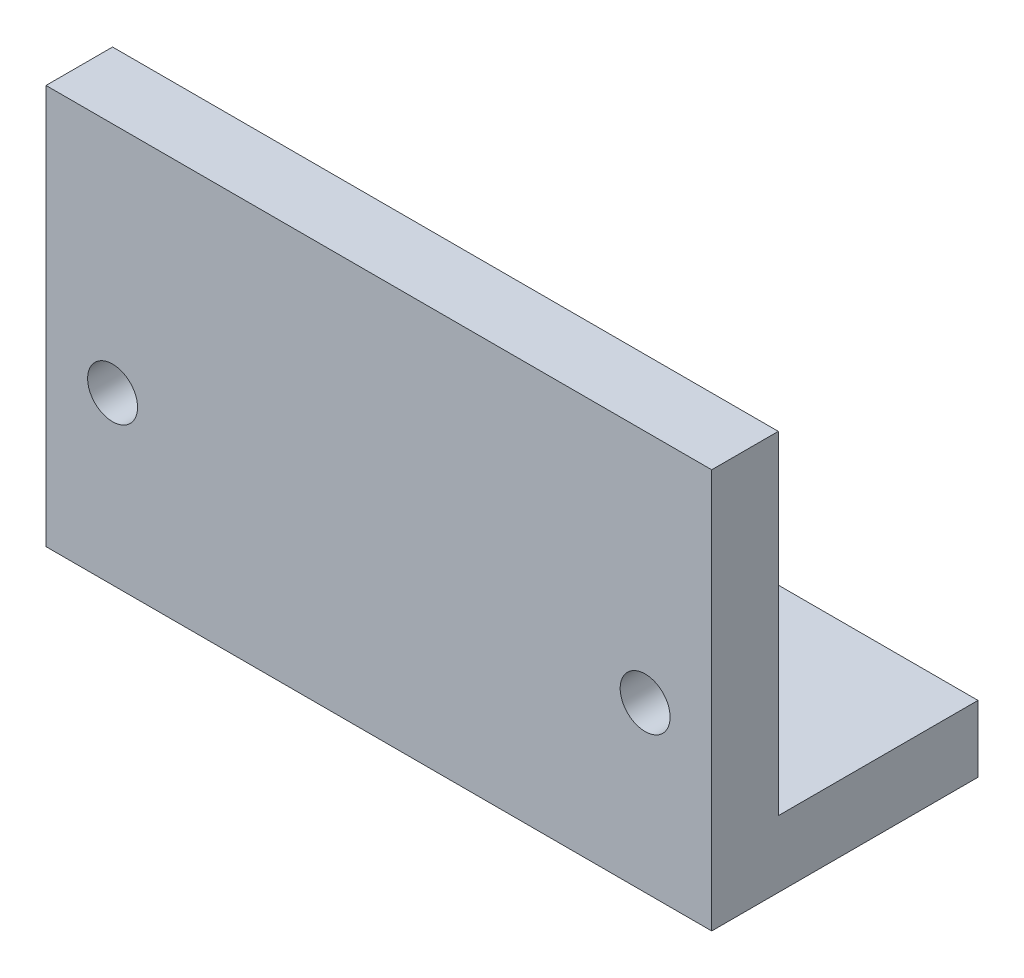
ISO-10303-21;
HEADER;
FILE_DESCRIPTION(('STEP AP214'),'2;1');
FILE_NAME('part.step','',(''),(''),'','','');
FILE_SCHEMA(('AUTOMOTIVE_DESIGN { 1 0 10303 214 1 1 1 1 }'));
ENDSEC;
DATA;
#1=APPLICATION_CONTEXT('core data for automotive mechanical design processes');
#2=APPLICATION_PROTOCOL_DEFINITION('international standard','automotive_design',2000,#1);
#3=PRODUCT_CONTEXT('',#1,'mechanical');
#4=PRODUCT('Part','Part','',(#3));
#5=PRODUCT_RELATED_PRODUCT_CATEGORY('part','',(#4));
#6=PRODUCT_DEFINITION_FORMATION('','',#4);
#7=PRODUCT_DEFINITION_CONTEXT('part definition',#1,'design');
#8=PRODUCT_DEFINITION('design','',#6,#7);
#9=PRODUCT_DEFINITION_SHAPE('','',#8);
#10=(LENGTH_UNIT() NAMED_UNIT(*) SI_UNIT(.MILLI.,.METRE.));
#11=(NAMED_UNIT(*) PLANE_ANGLE_UNIT() SI_UNIT($,.RADIAN.));
#12=(NAMED_UNIT(*) SI_UNIT($,.STERADIAN.) SOLID_ANGLE_UNIT());
#13=UNCERTAINTY_MEASURE_WITH_UNIT(LENGTH_MEASURE(1.E-05),#10,'distance_accuracy_value','');
#14=(GEOMETRIC_REPRESENTATION_CONTEXT(3) GLOBAL_UNCERTAINTY_ASSIGNED_CONTEXT((#13)) GLOBAL_UNIT_ASSIGNED_CONTEXT((#10,
#11,#12)) REPRESENTATION_CONTEXT('',''));
#15=CARTESIAN_POINT('',(0.,0.,0.));
#16=DIRECTION('',(0.,0.,1.));
#17=DIRECTION('',(1.,0.,0.));
#18=AXIS2_PLACEMENT_3D('',#15,#16,#17);
#19=CARTESIAN_POINT('',(0.,0.,20.));
#20=DIRECTION('',(1.,0.,0.));
#21=DIRECTION('',(0.,0.,-1.));
#22=AXIS2_PLACEMENT_3D('',#19,#20,#21);
#23=PLANE('',#22);
#24=DIRECTION('',(0.,-1.,0.));
#25=VECTOR('',#24,1.);
#26=CARTESIAN_POINT('',(0.,0.,0.));
#27=LINE('',#26,#25);
#28=CARTESIAN_POINT('',(0.,120.,0.));
#29=VERTEX_POINT('',#28);
#30=CARTESIAN_POINT('',(0.,20.,0.));
#31=VERTEX_POINT('',#30);
#32=EDGE_CURVE('E142',#29,#31,#27,.T.);
#33=ORIENTED_EDGE('',*,*,#32,.T.);
#34=DIRECTION('',(0.,0.,1.));
#35=VECTOR('',#34,1.);
#36=CARTESIAN_POINT('',(0.,20.,-60.));
#37=LINE('',#36,#35);
#38=CARTESIAN_POINT('',(0.,20.,-60.));
#39=VERTEX_POINT('',#38);
#40=EDGE_CURVE('E137',#39,#31,#37,.T.);
#41=ORIENTED_EDGE('',*,*,#40,.F.);
#42=DIRECTION('',(0.,1.,0.));
#43=VECTOR('',#42,1.);
#44=CARTESIAN_POINT('',(0.,0.,-60.));
#45=LINE('',#44,#43);
#46=CARTESIAN_POINT('',(0.,0.,-60.));
#47=VERTEX_POINT('',#46);
#48=EDGE_CURVE('E111',#47,#39,#45,.T.);
#49=ORIENTED_EDGE('',*,*,#48,.F.);
#50=DIRECTION('',(0.,0.,-1.));
#51=VECTOR('',#50,1.);
#52=CARTESIAN_POINT('',(0.,0.,20.));
#53=LINE('',#52,#51);
#54=CARTESIAN_POINT('',(0.,0.,20.));
#55=VERTEX_POINT('',#54);
#56=EDGE_CURVE('E11',#55,#47,#53,.T.);
#57=ORIENTED_EDGE('',*,*,#56,.F.);
#58=DIRECTION('',(0.,-1.,0.));
#59=VECTOR('',#58,1.);
#60=CARTESIAN_POINT('',(0.,0.,20.));
#61=LINE('',#60,#59);
#62=CARTESIAN_POINT('',(0.,120.,20.));
#63=VERTEX_POINT('',#62);
#64=EDGE_CURVE('E129',#63,#55,#61,.T.);
#65=ORIENTED_EDGE('',*,*,#64,.F.);
#66=DIRECTION('',(0.,0.,-1.));
#67=VECTOR('',#66,1.);
#68=CARTESIAN_POINT('',(0.,120.,20.));
#69=LINE('',#68,#67);
#70=EDGE_CURVE('E170',#63,#29,#69,.T.);
#71=ORIENTED_EDGE('',*,*,#70,.T.);
#72=EDGE_LOOP('',(#33,#41,#49,#57,#65,#71));
#73=FACE_BOUND('',#72,.T.);
#74=ADVANCED_FACE('F33',(#73),#23,.F.);
#75=CARTESIAN_POINT('',(0.,0.,20.));
#76=DIRECTION('',(0.,1.,0.));
#77=DIRECTION('',(0.,0.,1.));
#78=AXIS2_PLACEMENT_3D('',#75,#76,#77);
#79=PLANE('',#78);
#80=ORIENTED_EDGE('',*,*,#56,.T.);
#81=DIRECTION('',(-1.,0.,0.));
#82=VECTOR('',#81,1.);
#83=CARTESIAN_POINT('',(200.,0.,-60.));
#84=LINE('',#83,#82);
#85=CARTESIAN_POINT('',(200.,0.,-60.));
#86=VERTEX_POINT('',#85);
#87=EDGE_CURVE('E106',#86,#47,#84,.T.);
#88=ORIENTED_EDGE('',*,*,#87,.F.);
#89=DIRECTION('',(0.,0.,-1.));
#90=VECTOR('',#89,1.);
#91=CARTESIAN_POINT('',(200.,0.,20.));
#92=LINE('',#91,#90);
#93=CARTESIAN_POINT('',(200.,0.,20.));
#94=VERTEX_POINT('',#93);
#95=EDGE_CURVE('E41',#94,#86,#92,.T.);
#96=ORIENTED_EDGE('',*,*,#95,.F.);
#97=DIRECTION('',(1.,0.,0.));
#98=VECTOR('',#97,1.);
#99=CARTESIAN_POINT('',(0.,0.,20.));
#100=LINE('',#99,#98);
#101=EDGE_CURVE('E80',#55,#94,#100,.T.);
#102=ORIENTED_EDGE('',*,*,#101,.F.);
#103=EDGE_LOOP('',(#80,#88,#96,#102));
#104=FACE_BOUND('',#103,.T.);
#105=ADVANCED_FACE('F107',(#104),#79,.F.);
#106=CARTESIAN_POINT('',(200.,0.,20.));
#107=DIRECTION('',(-1.,0.,0.));
#108=DIRECTION('',(0.,0.,1.));
#109=AXIS2_PLACEMENT_3D('',#106,#107,#108);
#110=PLANE('',#109);
#111=ORIENTED_EDGE('',*,*,#95,.T.);
#112=DIRECTION('',(0.,-1.,0.));
#113=VECTOR('',#112,1.);
#114=CARTESIAN_POINT('',(200.,0.,-60.));
#115=LINE('',#114,#113);
#116=CARTESIAN_POINT('',(200.,20.,-60.));
#117=VERTEX_POINT('',#116);
#118=EDGE_CURVE('E100',#117,#86,#115,.T.);
#119=ORIENTED_EDGE('',*,*,#118,.F.);
#120=DIRECTION('',(0.,0.,1.));
#121=VECTOR('',#120,1.);
#122=CARTESIAN_POINT('',(200.,20.,-60.));
#123=LINE('',#122,#121);
#124=CARTESIAN_POINT('',(200.,20.,0.));
#125=VERTEX_POINT('',#124);
#126=EDGE_CURVE('E126',#117,#125,#123,.T.);
#127=ORIENTED_EDGE('',*,*,#126,.T.);
#128=DIRECTION('',(0.,1.,0.));
#129=VECTOR('',#128,1.);
#130=CARTESIAN_POINT('',(200.,0.,0.));
#131=LINE('',#130,#129);
#132=CARTESIAN_POINT('',(200.,120.,0.));
#133=VERTEX_POINT('',#132);
#134=EDGE_CURVE('E133',#125,#133,#131,.T.);
#135=ORIENTED_EDGE('',*,*,#134,.T.);
#136=DIRECTION('',(0.,0.,-1.));
#137=VECTOR('',#136,1.);
#138=CARTESIAN_POINT('',(200.,120.,20.));
#139=LINE('',#138,#137);
#140=CARTESIAN_POINT('',(200.,120.,20.));
#141=VERTEX_POINT('',#140);
#142=EDGE_CURVE('E103',#141,#133,#139,.T.);
#143=ORIENTED_EDGE('',*,*,#142,.F.);
#144=DIRECTION('',(0.,1.,0.));
#145=VECTOR('',#144,1.);
#146=CARTESIAN_POINT('',(200.,0.,20.));
#147=LINE('',#146,#145);
#148=EDGE_CURVE('E102',#94,#141,#147,.T.);
#149=ORIENTED_EDGE('',*,*,#148,.F.);
#150=EDGE_LOOP('',(#111,#119,#127,#135,#143,#149));
#151=FACE_BOUND('',#150,.T.);
#152=ADVANCED_FACE('F97',(#151),#110,.F.);
#153=CARTESIAN_POINT('',(0.,120.,20.));
#154=DIRECTION('',(0.,-1.,0.));
#155=DIRECTION('',(0.,0.,-1.));
#156=AXIS2_PLACEMENT_3D('',#153,#154,#155);
#157=PLANE('',#156);
#158=DIRECTION('',(-1.,0.,0.));
#159=VECTOR('',#158,1.);
#160=CARTESIAN_POINT('',(0.,120.,0.));
#161=LINE('',#160,#159);
#162=EDGE_CURVE('E73',#133,#29,#161,.T.);
#163=ORIENTED_EDGE('',*,*,#162,.T.);
#164=ORIENTED_EDGE('',*,*,#70,.F.);
#165=DIRECTION('',(-1.,0.,0.));
#166=VECTOR('',#165,1.);
#167=CARTESIAN_POINT('',(0.,120.,20.));
#168=LINE('',#167,#166);
#169=EDGE_CURVE('E58',#141,#63,#168,.T.);
#170=ORIENTED_EDGE('',*,*,#169,.F.);
#171=ORIENTED_EDGE('',*,*,#142,.T.);
#172=EDGE_LOOP('',(#163,#164,#170,#171));
#173=FACE_BOUND('',#172,.T.);
#174=ADVANCED_FACE('F163',(#173),#157,.F.);
#175=CARTESIAN_POINT('',(0.,120.,20.));
#176=DIRECTION('',(0.,0.,-1.));
#177=DIRECTION('',(-1.,0.,0.));
#178=AXIS2_PLACEMENT_3D('',#175,#176,#177);
#179=PLANE('',#178);
#180=CARTESIAN_POINT('',(180.,49.3880748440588,20.));
#181=DIRECTION('',(0.,0.,1.));
#182=DIRECTION('',(1.,0.,0.));
#183=AXIS2_PLACEMENT_3D('',#180,#181,#182);
#184=CIRCLE('',#183,7.50000000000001);
#185=CARTESIAN_POINT('',(187.5,49.3880748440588,20.));
#186=VERTEX_POINT('',#185);
#187=EDGE_CURVE('E151',#186,#186,#184,.T.);
#188=ORIENTED_EDGE('',*,*,#187,.F.);
#189=EDGE_LOOP('',(#188));
#190=FACE_BOUND('',#189,.T.);
#191=CARTESIAN_POINT('',(20.,50.,20.));
#192=DIRECTION('',(0.,0.,1.));
#193=DIRECTION('',(1.,0.,0.));
#194=AXIS2_PLACEMENT_3D('',#191,#192,#193);
#195=CIRCLE('',#194,7.5);
#196=CARTESIAN_POINT('',(27.5,50.,20.));
#197=VERTEX_POINT('',#196);
#198=EDGE_CURVE('E121',#197,#197,#195,.T.);
#199=ORIENTED_EDGE('',*,*,#198,.F.);
#200=EDGE_LOOP('',(#199));
#201=FACE_BOUND('',#200,.T.);
#202=ORIENTED_EDGE('',*,*,#64,.T.);
#203=ORIENTED_EDGE('',*,*,#101,.T.);
#204=ORIENTED_EDGE('',*,*,#148,.T.);
#205=ORIENTED_EDGE('',*,*,#169,.T.);
#206=EDGE_LOOP('',(#202,#203,#204,#205));
#207=FACE_BOUND('',#206,.T.);
#208=ADVANCED_FACE('F159',(#190,#201,#207),#179,.F.);
#209=CARTESIAN_POINT('',(0.,120.,0.));
#210=DIRECTION('',(0.,0.,-1.));
#211=DIRECTION('',(-1.,0.,0.));
#212=AXIS2_PLACEMENT_3D('',#209,#210,#211);
#213=PLANE('',#212);
#214=CARTESIAN_POINT('',(180.,49.3880748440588,0.));
#215=DIRECTION('',(0.,0.,-1.));
#216=DIRECTION('',(-1.,0.,0.));
#217=AXIS2_PLACEMENT_3D('',#214,#215,#216);
#218=CIRCLE('',#217,7.50000000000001);
#219=CARTESIAN_POINT('',(187.5,49.3880748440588,0.));
#220=VERTEX_POINT('',#219);
#221=EDGE_CURVE('E36',#220,#220,#218,.T.);
#222=ORIENTED_EDGE('',*,*,#221,.F.);
#223=EDGE_LOOP('',(#222));
#224=FACE_BOUND('',#223,.T.);
#225=CARTESIAN_POINT('',(20.,50.,0.));
#226=DIRECTION('',(0.,0.,-1.));
#227=DIRECTION('',(-1.,0.,0.));
#228=AXIS2_PLACEMENT_3D('',#225,#226,#227);
#229=CIRCLE('',#228,7.5);
#230=CARTESIAN_POINT('',(27.5,50.,0.));
#231=VERTEX_POINT('',#230);
#232=EDGE_CURVE('E118',#231,#231,#229,.T.);
#233=ORIENTED_EDGE('',*,*,#232,.F.);
#234=EDGE_LOOP('',(#233));
#235=FACE_BOUND('',#234,.T.);
#236=DIRECTION('',(1.,0.,0.));
#237=VECTOR('',#236,1.);
#238=CARTESIAN_POINT('',(200.,20.,0.));
#239=LINE('',#238,#237);
#240=EDGE_CURVE('E49',#31,#125,#239,.T.);
#241=ORIENTED_EDGE('',*,*,#240,.F.);
#242=ORIENTED_EDGE('',*,*,#32,.F.);
#243=ORIENTED_EDGE('',*,*,#162,.F.);
#244=ORIENTED_EDGE('',*,*,#134,.F.);
#245=EDGE_LOOP('',(#241,#242,#243,#244));
#246=FACE_BOUND('',#245,.T.);
#247=ADVANCED_FACE('F162',(#224,#235,#246),#213,.T.);
#248=CARTESIAN_POINT('',(200.,20.,-60.));
#249=DIRECTION('',(0.,-1.,0.));
#250=DIRECTION('',(1.,0.,0.));
#251=AXIS2_PLACEMENT_3D('',#248,#249,#250);
#252=PLANE('',#251);
#253=ORIENTED_EDGE('',*,*,#240,.T.);
#254=ORIENTED_EDGE('',*,*,#126,.F.);
#255=DIRECTION('',(1.,0.,0.));
#256=VECTOR('',#255,1.);
#257=CARTESIAN_POINT('',(200.,20.,-60.));
#258=LINE('',#257,#256);
#259=EDGE_CURVE('E115',#39,#117,#258,.T.);
#260=ORIENTED_EDGE('',*,*,#259,.F.);
#261=ORIENTED_EDGE('',*,*,#40,.T.);
#262=EDGE_LOOP('',(#253,#254,#260,#261));
#263=FACE_BOUND('',#262,.T.);
#264=ADVANCED_FACE('F169',(#263),#252,.F.);
#265=CARTESIAN_POINT('',(200.,20.,-60.));
#266=DIRECTION('',(0.,0.,1.));
#267=DIRECTION('',(1.,0.,0.));
#268=AXIS2_PLACEMENT_3D('',#265,#266,#267);
#269=PLANE('',#268);
#270=ORIENTED_EDGE('',*,*,#118,.T.);
#271=ORIENTED_EDGE('',*,*,#87,.T.);
#272=ORIENTED_EDGE('',*,*,#48,.T.);
#273=ORIENTED_EDGE('',*,*,#259,.T.);
#274=EDGE_LOOP('',(#270,#271,#272,#273));
#275=FACE_BOUND('',#274,.T.);
#276=ADVANCED_FACE('F113',(#275),#269,.F.);
#277=CARTESIAN_POINT('',(20.,50.,-60.000025));
#278=DIRECTION('',(0.,0.,1.));
#279=DIRECTION('',(1.,0.,0.));
#280=AXIS2_PLACEMENT_3D('',#277,#278,#279);
#281=CYLINDRICAL_SURFACE('',#280,7.5);
#282=CARTESIAN_POINT('',(27.5,50.,0.));
#283=CARTESIAN_POINT('',(27.5,50.,0.20833333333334));
#284=CARTESIAN_POINT('',(27.5,50.,0.416666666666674));
#285=CARTESIAN_POINT('',(27.5,50.,0.833333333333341));
#286=CARTESIAN_POINT('',(27.5,50.,1.04166666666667));
#287=CARTESIAN_POINT('',(27.5,50.,1.45833333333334));
#288=CARTESIAN_POINT('',(27.5,50.,1.66666666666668));
#289=CARTESIAN_POINT('',(27.5,50.,2.08333333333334));
#290=CARTESIAN_POINT('',(27.5,50.,2.29166666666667));
#291=CARTESIAN_POINT('',(27.5,50.,2.70833333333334));
#292=CARTESIAN_POINT('',(27.5,50.,2.91666666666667));
#293=CARTESIAN_POINT('',(27.5,50.,3.33333333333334));
#294=CARTESIAN_POINT('',(27.5,50.,3.54166666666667));
#295=CARTESIAN_POINT('',(27.5,50.,3.95833333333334));
#296=CARTESIAN_POINT('',(27.5,50.,4.16666666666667));
#297=CARTESIAN_POINT('',(27.5,50.,4.58333333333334));
#298=CARTESIAN_POINT('',(27.5,50.,4.79166666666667));
#299=CARTESIAN_POINT('',(27.5,50.,5.20833333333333));
#300=CARTESIAN_POINT('',(27.5,50.,5.41666666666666));
#301=CARTESIAN_POINT('',(27.5,50.,5.83333333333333));
#302=CARTESIAN_POINT('',(27.5,50.,6.04166666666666));
#303=CARTESIAN_POINT('',(27.5,50.,6.45833333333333));
#304=CARTESIAN_POINT('',(27.5,50.,6.66666666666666));
#305=CARTESIAN_POINT('',(27.5,50.,7.08333333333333));
#306=CARTESIAN_POINT('',(27.5,50.,7.29166666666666));
#307=CARTESIAN_POINT('',(27.5,50.,7.70833333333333));
#308=CARTESIAN_POINT('',(27.5,50.,7.91666666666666));
#309=CARTESIAN_POINT('',(27.5,50.,8.33333333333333));
#310=CARTESIAN_POINT('',(27.5,50.,8.54166666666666));
#311=CARTESIAN_POINT('',(27.5,50.,8.95833333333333));
#312=CARTESIAN_POINT('',(27.5,50.,9.16666666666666));
#313=CARTESIAN_POINT('',(27.5,50.,9.58333333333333));
#314=CARTESIAN_POINT('',(27.5,50.,9.79166666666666));
#315=CARTESIAN_POINT('',(27.5,50.,10.2083333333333));
#316=CARTESIAN_POINT('',(27.5,50.,10.4166666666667));
#317=CARTESIAN_POINT('',(27.5,50.,10.8333333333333));
#318=CARTESIAN_POINT('',(27.5,50.,11.0416666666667));
#319=CARTESIAN_POINT('',(27.5,50.,11.4583333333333));
#320=CARTESIAN_POINT('',(27.5,50.,11.6666666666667));
#321=CARTESIAN_POINT('',(27.5,50.,12.0833333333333));
#322=CARTESIAN_POINT('',(27.5,50.,12.2916666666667));
#323=CARTESIAN_POINT('',(27.5,50.,12.7083333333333));
#324=CARTESIAN_POINT('',(27.5,50.,12.9166666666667));
#325=CARTESIAN_POINT('',(27.5,50.,13.3333333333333));
#326=CARTESIAN_POINT('',(27.5,50.,13.5416666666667));
#327=CARTESIAN_POINT('',(27.5,50.,13.9583333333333));
#328=CARTESIAN_POINT('',(27.5,50.,14.1666666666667));
#329=CARTESIAN_POINT('',(27.5,50.,14.5833333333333));
#330=CARTESIAN_POINT('',(27.5,50.,14.7916666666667));
#331=CARTESIAN_POINT('',(27.5,50.,15.2083333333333));
#332=CARTESIAN_POINT('',(27.5,50.,15.4166666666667));
#333=CARTESIAN_POINT('',(27.5,50.,15.8333333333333));
#334=CARTESIAN_POINT('',(27.5,50.,16.0416666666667));
#335=CARTESIAN_POINT('',(27.5,50.,16.4583333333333));
#336=CARTESIAN_POINT('',(27.5,50.,16.6666666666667));
#337=CARTESIAN_POINT('',(27.5,50.,17.0833333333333));
#338=CARTESIAN_POINT('',(27.5,50.,17.2916666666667));
#339=CARTESIAN_POINT('',(27.5,50.,17.7083333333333));
#340=CARTESIAN_POINT('',(27.5,50.,17.9166666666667));
#341=CARTESIAN_POINT('',(27.5,50.,18.3333333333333));
#342=CARTESIAN_POINT('',(27.5,50.,18.5416666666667));
#343=CARTESIAN_POINT('',(27.5,50.,18.9583333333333));
#344=CARTESIAN_POINT('',(27.5,50.,19.1666666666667));
#345=CARTESIAN_POINT('',(27.5,50.,19.5833333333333));
#346=CARTESIAN_POINT('',(27.5,50.,19.7916666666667));
#347=CARTESIAN_POINT('',(27.5,50.,20.));
#348=B_SPLINE_CURVE_WITH_KNOTS('',3,(#282,#283,#284,#285,#286,#287,#288,#289,#290,#291,#292,
#293,#294,#295,#296,#297,#298,#299,#300,#301,#302,#303,#304,#305,#306,#307,#308,#309,#310,#311,
#312,#313,#314,#315,#316,#317,#318,#319,#320,#321,#322,#323,#324,#325,#326,#327,#328,#329,#330,
#331,#332,#333,#334,#335,#336,#337,#338,#339,#340,#341,#342,#343,#344,#345,#346,#347),
.UNSPECIFIED.,.F.,.F.,(4,2,2,2,2,2,2,2,2,2,2,2,2,2,2,2,2,2,2,2,2,2,2,2,2,2,2,2,2,2,2,2,4),(0.,
0.625000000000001,1.25,1.875,2.5,3.125,3.75,4.375,5.,5.62499999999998,6.24999999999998,
6.87499999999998,7.49999999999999,8.12499999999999,8.74999999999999,9.37499999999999,
9.99999999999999,10.625,11.25,11.875,12.5,13.125,13.75,14.375,15.,15.625,16.25,16.875,17.5,
18.125,18.75,19.375,20.),.UNSPECIFIED.);
#349=EDGE_CURVE('BSEAM211',#231,#197,#348,.T.);
#350=ORIENTED_EDGE('',*,*,#232,.T.);
#351=ORIENTED_EDGE('',*,*,#198,.T.);
#352=ORIENTED_EDGE('',*,*,#349,.T.);
#353=ORIENTED_EDGE('',*,*,#349,.F.);
#354=EDGE_LOOP('',(#350,#352,#351,#353));
#355=FACE_BOUND('',#354,.T.);
#356=ADVANCED_FACE('F211',(#355),#281,.F.);
#357=CARTESIAN_POINT('',(180.,49.3880748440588,-60.000025));
#358=DIRECTION('',(0.,0.,1.));
#359=DIRECTION('',(1.,0.,0.));
#360=AXIS2_PLACEMENT_3D('',#357,#358,#359);
#361=CYLINDRICAL_SURFACE('',#360,7.50000000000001);
#362=CARTESIAN_POINT('',(187.5,49.3880748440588,0.));
#363=CARTESIAN_POINT('',(187.5,49.3880748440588,0.20833333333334));
#364=CARTESIAN_POINT('',(187.5,49.3880748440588,0.416666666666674));
#365=CARTESIAN_POINT('',(187.5,49.3880748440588,0.833333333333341));
#366=CARTESIAN_POINT('',(187.5,49.3880748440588,1.04166666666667));
#367=CARTESIAN_POINT('',(187.5,49.3880748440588,1.45833333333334));
#368=CARTESIAN_POINT('',(187.5,49.3880748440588,1.66666666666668));
#369=CARTESIAN_POINT('',(187.5,49.3880748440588,2.08333333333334));
#370=CARTESIAN_POINT('',(187.5,49.3880748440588,2.29166666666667));
#371=CARTESIAN_POINT('',(187.5,49.3880748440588,2.70833333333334));
#372=CARTESIAN_POINT('',(187.5,49.3880748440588,2.91666666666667));
#373=CARTESIAN_POINT('',(187.5,49.3880748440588,3.33333333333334));
#374=CARTESIAN_POINT('',(187.5,49.3880748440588,3.54166666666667));
#375=CARTESIAN_POINT('',(187.5,49.3880748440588,3.95833333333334));
#376=CARTESIAN_POINT('',(187.5,49.3880748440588,4.16666666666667));
#377=CARTESIAN_POINT('',(187.5,49.3880748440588,4.58333333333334));
#378=CARTESIAN_POINT('',(187.5,49.3880748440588,4.79166666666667));
#379=CARTESIAN_POINT('',(187.5,49.3880748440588,5.20833333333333));
#380=CARTESIAN_POINT('',(187.5,49.3880748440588,5.41666666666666));
#381=CARTESIAN_POINT('',(187.5,49.3880748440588,5.83333333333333));
#382=CARTESIAN_POINT('',(187.5,49.3880748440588,6.04166666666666));
#383=CARTESIAN_POINT('',(187.5,49.3880748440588,6.45833333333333));
#384=CARTESIAN_POINT('',(187.5,49.3880748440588,6.66666666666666));
#385=CARTESIAN_POINT('',(187.5,49.3880748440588,7.08333333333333));
#386=CARTESIAN_POINT('',(187.5,49.3880748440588,7.29166666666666));
#387=CARTESIAN_POINT('',(187.5,49.3880748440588,7.70833333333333));
#388=CARTESIAN_POINT('',(187.5,49.3880748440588,7.91666666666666));
#389=CARTESIAN_POINT('',(187.5,49.3880748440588,8.33333333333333));
#390=CARTESIAN_POINT('',(187.5,49.3880748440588,8.54166666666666));
#391=CARTESIAN_POINT('',(187.5,49.3880748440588,8.95833333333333));
#392=CARTESIAN_POINT('',(187.5,49.3880748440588,9.16666666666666));
#393=CARTESIAN_POINT('',(187.5,49.3880748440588,9.58333333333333));
#394=CARTESIAN_POINT('',(187.5,49.3880748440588,9.79166666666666));
#395=CARTESIAN_POINT('',(187.5,49.3880748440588,10.2083333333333));
#396=CARTESIAN_POINT('',(187.5,49.3880748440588,10.4166666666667));
#397=CARTESIAN_POINT('',(187.5,49.3880748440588,10.8333333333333));
#398=CARTESIAN_POINT('',(187.5,49.3880748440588,11.0416666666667));
#399=CARTESIAN_POINT('',(187.5,49.3880748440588,11.4583333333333));
#400=CARTESIAN_POINT('',(187.5,49.3880748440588,11.6666666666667));
#401=CARTESIAN_POINT('',(187.5,49.3880748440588,12.0833333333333));
#402=CARTESIAN_POINT('',(187.5,49.3880748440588,12.2916666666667));
#403=CARTESIAN_POINT('',(187.5,49.3880748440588,12.7083333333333));
#404=CARTESIAN_POINT('',(187.5,49.3880748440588,12.9166666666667));
#405=CARTESIAN_POINT('',(187.5,49.3880748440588,13.3333333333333));
#406=CARTESIAN_POINT('',(187.5,49.3880748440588,13.5416666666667));
#407=CARTESIAN_POINT('',(187.5,49.3880748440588,13.9583333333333));
#408=CARTESIAN_POINT('',(187.5,49.3880748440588,14.1666666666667));
#409=CARTESIAN_POINT('',(187.5,49.3880748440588,14.5833333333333));
#410=CARTESIAN_POINT('',(187.5,49.3880748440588,14.7916666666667));
#411=CARTESIAN_POINT('',(187.5,49.3880748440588,15.2083333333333));
#412=CARTESIAN_POINT('',(187.5,49.3880748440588,15.4166666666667));
#413=CARTESIAN_POINT('',(187.5,49.3880748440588,15.8333333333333));
#414=CARTESIAN_POINT('',(187.5,49.3880748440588,16.0416666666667));
#415=CARTESIAN_POINT('',(187.5,49.3880748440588,16.4583333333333));
#416=CARTESIAN_POINT('',(187.5,49.3880748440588,16.6666666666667));
#417=CARTESIAN_POINT('',(187.5,49.3880748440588,17.0833333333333));
#418=CARTESIAN_POINT('',(187.5,49.3880748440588,17.2916666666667));
#419=CARTESIAN_POINT('',(187.5,49.3880748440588,17.7083333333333));
#420=CARTESIAN_POINT('',(187.5,49.3880748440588,17.9166666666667));
#421=CARTESIAN_POINT('',(187.5,49.3880748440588,18.3333333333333));
#422=CARTESIAN_POINT('',(187.5,49.3880748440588,18.5416666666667));
#423=CARTESIAN_POINT('',(187.5,49.3880748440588,18.9583333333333));
#424=CARTESIAN_POINT('',(187.5,49.3880748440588,19.1666666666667));
#425=CARTESIAN_POINT('',(187.5,49.3880748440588,19.5833333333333));
#426=CARTESIAN_POINT('',(187.5,49.3880748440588,19.7916666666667));
#427=CARTESIAN_POINT('',(187.5,49.3880748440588,20.));
#428=B_SPLINE_CURVE_WITH_KNOTS('',3,(#362,#363,#364,#365,#366,#367,#368,#369,#370,#371,#372,
#373,#374,#375,#376,#377,#378,#379,#380,#381,#382,#383,#384,#385,#386,#387,#388,#389,#390,#391,
#392,#393,#394,#395,#396,#397,#398,#399,#400,#401,#402,#403,#404,#405,#406,#407,#408,#409,#410,
#411,#412,#413,#414,#415,#416,#417,#418,#419,#420,#421,#422,#423,#424,#425,#426,#427),
.UNSPECIFIED.,.F.,.F.,(4,2,2,2,2,2,2,2,2,2,2,2,2,2,2,2,2,2,2,2,2,2,2,2,2,2,2,2,2,2,2,2,4),(0.,
0.625000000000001,1.25,1.875,2.5,3.125,3.75,4.375,5.,5.62499999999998,6.24999999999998,
6.87499999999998,7.49999999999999,8.12499999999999,8.74999999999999,9.37499999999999,
9.99999999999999,10.625,11.25,11.875,12.5,13.125,13.75,14.375,15.,15.625,16.25,16.875,17.5,
18.125,18.75,19.375,20.),.UNSPECIFIED.);
#429=EDGE_CURVE('BSEAM157',#220,#186,#428,.T.);
#430=ORIENTED_EDGE('',*,*,#221,.T.);
#431=ORIENTED_EDGE('',*,*,#187,.T.);
#432=ORIENTED_EDGE('',*,*,#429,.T.);
#433=ORIENTED_EDGE('',*,*,#429,.F.);
#434=EDGE_LOOP('',(#430,#432,#431,#433));
#435=FACE_BOUND('',#434,.T.);
#436=ADVANCED_FACE('F157',(#435),#361,.F.);
#437=CLOSED_SHELL('',(#74,#105,#152,#174,#208,#247,#264,#276,#356,#436));
#438=MANIFOLD_SOLID_BREP('B2',#437);
#439=ADVANCED_BREP_SHAPE_REPRESENTATION('',(#18,#438),#14);
#440=SHAPE_DEFINITION_REPRESENTATION(#9,#439);
ENDSEC;
END-ISO-10303-21;
